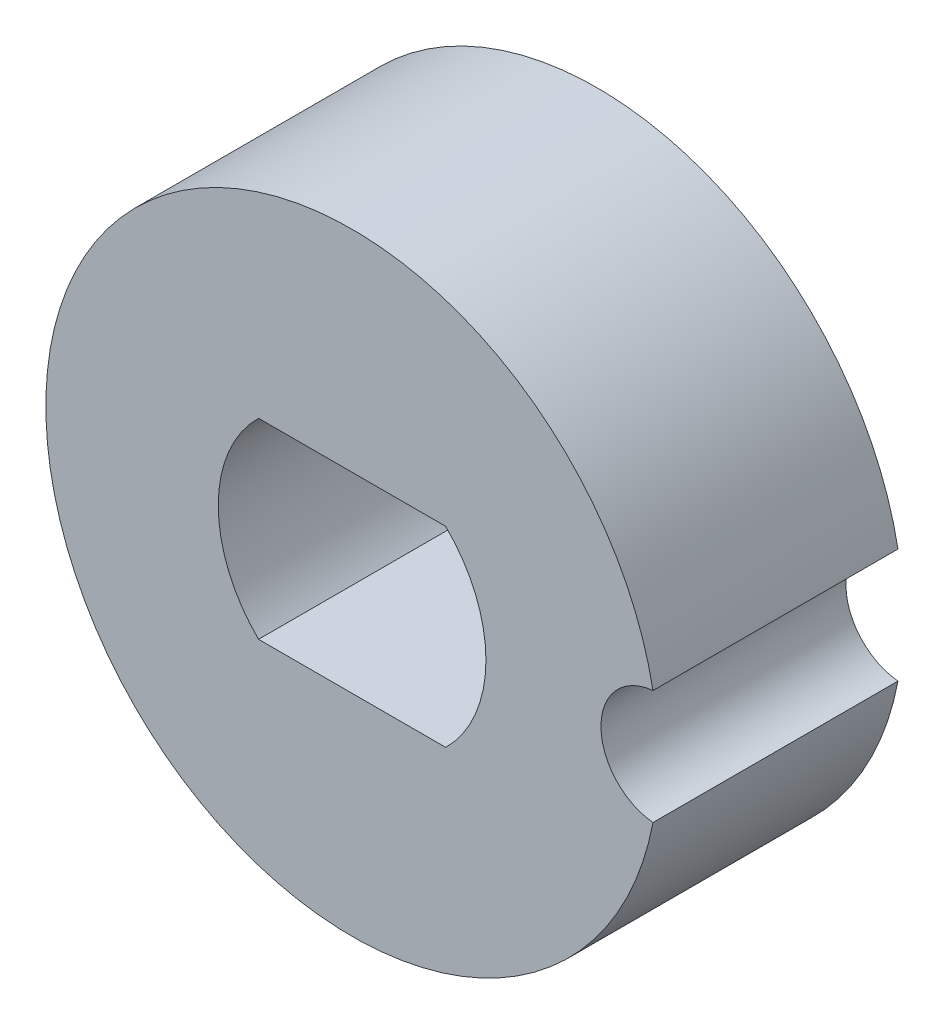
ISO-10303-21;
HEADER;
FILE_DESCRIPTION(('STEP AP214'),'2;1');
FILE_NAME('part.step','',(''),(''),'','','');
FILE_SCHEMA(('AUTOMOTIVE_DESIGN { 1 0 10303 214 1 1 1 1 }'));
ENDSEC;
DATA;
#1=APPLICATION_CONTEXT('core data for automotive mechanical design processes');
#2=APPLICATION_PROTOCOL_DEFINITION('international standard','automotive_design',2000,#1);
#3=PRODUCT_CONTEXT('',#1,'mechanical');
#4=PRODUCT('Part','Part','',(#3));
#5=PRODUCT_RELATED_PRODUCT_CATEGORY('part','',(#4));
#6=PRODUCT_DEFINITION_FORMATION('','',#4);
#7=PRODUCT_DEFINITION_CONTEXT('part definition',#1,'design');
#8=PRODUCT_DEFINITION('design','',#6,#7);
#9=PRODUCT_DEFINITION_SHAPE('','',#8);
#10=(LENGTH_UNIT() NAMED_UNIT(*) SI_UNIT(.MILLI.,.METRE.));
#11=(NAMED_UNIT(*) PLANE_ANGLE_UNIT() SI_UNIT($,.RADIAN.));
#12=(NAMED_UNIT(*) SI_UNIT($,.STERADIAN.) SOLID_ANGLE_UNIT());
#13=UNCERTAINTY_MEASURE_WITH_UNIT(LENGTH_MEASURE(1.E-05),#10,'distance_accuracy_value','');
#14=(GEOMETRIC_REPRESENTATION_CONTEXT(3) GLOBAL_UNCERTAINTY_ASSIGNED_CONTEXT((#13)) GLOBAL_UNIT_ASSIGNED_CONTEXT((#10,
#11,#12)) REPRESENTATION_CONTEXT('',''));
#15=CARTESIAN_POINT('',(0.,0.,0.));
#16=DIRECTION('',(0.,0.,1.));
#17=DIRECTION('',(1.,0.,0.));
#18=AXIS2_PLACEMENT_3D('',#15,#16,#17);
#19=CARTESIAN_POINT('',(6.35,0.,10.16));
#20=DIRECTION('',(0.,0.,1.));
#21=DIRECTION('',(1.,0.,0.));
#22=AXIS2_PLACEMENT_3D('',#19,#20,#21);
#23=PLANE('',#22);
#24=CARTESIAN_POINT('',(0.,0.,10.16));
#25=DIRECTION('',(0.,0.,1.));
#26=DIRECTION('',(1.,0.,0.));
#27=AXIS2_PLACEMENT_3D('',#24,#25,#26);
#28=CIRCLE('',#27,12.7);
#29=CARTESIAN_POINT('',(12.4767578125,2.37076242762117,10.16));
#30=VERTEX_POINT('',#29);
#31=CARTESIAN_POINT('',(12.4767578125,-2.37076242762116,10.16));
#32=VERTEX_POINT('',#31);
#33=EDGE_CURVE('E108',#30,#32,#28,.T.);
#34=ORIENTED_EDGE('',*,*,#33,.T.);
#35=CARTESIAN_POINT('',(12.7,0.,10.16));
#36=DIRECTION('',(0.,0.,1.));
#37=DIRECTION('',(1.,0.,0.));
#38=AXIS2_PLACEMENT_3D('',#35,#36,#37);
#39=CIRCLE('',#38,2.38125);
#40=EDGE_CURVE('E111',#30,#32,#39,.T.);
#41=ORIENTED_EDGE('',*,*,#40,.F.);
#42=EDGE_LOOP('',(#34,#41));
#43=FACE_BOUND('',#42,.T.);
#44=DIRECTION('',(-1.,0.,0.));
#45=VECTOR('',#44,1.);
#46=CARTESIAN_POINT('',(3.87948623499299,-3.96875,10.16));
#47=LINE('',#46,#45);
#48=CARTESIAN_POINT('',(3.87948623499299,-3.96875,10.16));
#49=VERTEX_POINT('',#48);
#50=CARTESIAN_POINT('',(-3.87948623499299,-3.96875,10.16));
#51=VERTEX_POINT('',#50);
#52=EDGE_CURVE('E92',#49,#51,#47,.T.);
#53=ORIENTED_EDGE('',*,*,#52,.T.);
#54=CARTESIAN_POINT('',(0.,0.,10.16));
#55=DIRECTION('',(0.,0.,1.));
#56=DIRECTION('',(1.,0.,0.));
#57=AXIS2_PLACEMENT_3D('',#54,#55,#56);
#58=CIRCLE('',#57,5.5499);
#59=CARTESIAN_POINT('',(-3.87948623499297,3.96875,10.16));
#60=VERTEX_POINT('',#59);
#61=EDGE_CURVE('E68',#60,#51,#58,.T.);
#62=ORIENTED_EDGE('',*,*,#61,.F.);
#63=DIRECTION('',(-1.,0.,0.));
#64=VECTOR('',#63,1.);
#65=CARTESIAN_POINT('',(3.87948623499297,3.96875,10.16));
#66=LINE('',#65,#64);
#67=CARTESIAN_POINT('',(3.87948623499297,3.96875,10.16));
#68=VERTEX_POINT('',#67);
#69=EDGE_CURVE('E95',#68,#60,#66,.T.);
#70=ORIENTED_EDGE('',*,*,#69,.F.);
#71=CARTESIAN_POINT('',(0.,0.,10.16));
#72=DIRECTION('',(0.,0.,1.));
#73=DIRECTION('',(1.,0.,0.));
#74=AXIS2_PLACEMENT_3D('',#71,#72,#73);
#75=CIRCLE('',#74,5.5499);
#76=EDGE_CURVE('E29',#49,#68,#75,.T.);
#77=ORIENTED_EDGE('',*,*,#76,.F.);
#78=EDGE_LOOP('',(#53,#62,#70,#77));
#79=FACE_BOUND('',#78,.T.);
#80=ADVANCED_FACE('F14',(#43,#79),#23,.T.);
#81=CARTESIAN_POINT('',(6.35,0.,0.));
#82=DIRECTION('',(0.,0.,1.));
#83=DIRECTION('',(1.,0.,0.));
#84=AXIS2_PLACEMENT_3D('',#81,#82,#83);
#85=PLANE('',#84);
#86=CARTESIAN_POINT('',(0.,0.,0.));
#87=DIRECTION('',(0.,0.,1.));
#88=DIRECTION('',(1.,0.,0.));
#89=AXIS2_PLACEMENT_3D('',#86,#87,#88);
#90=CIRCLE('',#89,12.7);
#91=CARTESIAN_POINT('',(12.4767578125,2.37076242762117,0.));
#92=VERTEX_POINT('',#91);
#93=CARTESIAN_POINT('',(12.4767578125,-2.37076242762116,0.));
#94=VERTEX_POINT('',#93);
#95=EDGE_CURVE('E72',#92,#94,#90,.T.);
#96=ORIENTED_EDGE('',*,*,#95,.F.);
#97=CARTESIAN_POINT('',(12.7,0.,0.));
#98=DIRECTION('',(0.,0.,1.));
#99=DIRECTION('',(1.,0.,0.));
#100=AXIS2_PLACEMENT_3D('',#97,#98,#99);
#101=CIRCLE('',#100,2.38125);
#102=EDGE_CURVE('E105',#92,#94,#101,.T.);
#103=ORIENTED_EDGE('',*,*,#102,.T.);
#104=EDGE_LOOP('',(#96,#103));
#105=FACE_BOUND('',#104,.T.);
#106=CARTESIAN_POINT('',(0.,0.,0.));
#107=DIRECTION('',(0.,0.,1.));
#108=DIRECTION('',(1.,0.,0.));
#109=AXIS2_PLACEMENT_3D('',#106,#107,#108);
#110=CIRCLE('',#109,5.5499);
#111=CARTESIAN_POINT('',(-3.87948623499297,3.96875,0.));
#112=VERTEX_POINT('',#111);
#113=CARTESIAN_POINT('',(-3.87948623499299,-3.96875,0.));
#114=VERTEX_POINT('',#113);
#115=EDGE_CURVE('E37',#112,#114,#110,.T.);
#116=ORIENTED_EDGE('',*,*,#115,.T.);
#117=DIRECTION('',(-1.,0.,0.));
#118=VECTOR('',#117,1.);
#119=CARTESIAN_POINT('',(3.87948623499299,-3.96875,0.));
#120=LINE('',#119,#118);
#121=CARTESIAN_POINT('',(3.87948623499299,-3.96875,0.));
#122=VERTEX_POINT('',#121);
#123=EDGE_CURVE('E76',#122,#114,#120,.T.);
#124=ORIENTED_EDGE('',*,*,#123,.F.);
#125=CARTESIAN_POINT('',(0.,0.,0.));
#126=DIRECTION('',(0.,0.,1.));
#127=DIRECTION('',(1.,0.,0.));
#128=AXIS2_PLACEMENT_3D('',#125,#126,#127);
#129=CIRCLE('',#128,5.5499);
#130=CARTESIAN_POINT('',(3.87948623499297,3.96875,0.));
#131=VERTEX_POINT('',#130);
#132=EDGE_CURVE('E81',#122,#131,#129,.T.);
#133=ORIENTED_EDGE('',*,*,#132,.T.);
#134=DIRECTION('',(-1.,0.,0.));
#135=VECTOR('',#134,1.);
#136=CARTESIAN_POINT('',(3.87948623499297,3.96875,0.));
#137=LINE('',#136,#135);
#138=EDGE_CURVE('E86',#131,#112,#137,.T.);
#139=ORIENTED_EDGE('',*,*,#138,.T.);
#140=EDGE_LOOP('',(#116,#124,#133,#139));
#141=FACE_BOUND('',#140,.T.);
#142=ADVANCED_FACE('F84',(#105,#141),#85,.F.);
#143=CARTESIAN_POINT('',(0.,0.,10.16));
#144=DIRECTION('',(0.,0.,-1.));
#145=DIRECTION('',(-1.,0.,0.));
#146=AXIS2_PLACEMENT_3D('',#143,#144,#145);
#147=CYLINDRICAL_SURFACE('',#146,12.7);
#148=DIRECTION('',(0.,0.,-1.));
#149=VECTOR('',#148,1.);
#150=CARTESIAN_POINT('',(12.4767578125,-2.37076242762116,10.16));
#151=LINE('',#150,#149);
#152=EDGE_CURVE('E9',#32,#94,#151,.T.);
#153=ORIENTED_EDGE('',*,*,#152,.F.);
#154=ORIENTED_EDGE('',*,*,#33,.F.);
#155=DIRECTION('',(0.,0.,-1.));
#156=VECTOR('',#155,1.);
#157=CARTESIAN_POINT('',(12.4767578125,2.37076242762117,10.16));
#158=LINE('',#157,#156);
#159=EDGE_CURVE('E22',#30,#92,#158,.T.);
#160=ORIENTED_EDGE('',*,*,#159,.T.);
#161=ORIENTED_EDGE('',*,*,#95,.T.);
#162=EDGE_LOOP('',(#153,#154,#160,#161));
#163=FACE_BOUND('',#162,.T.);
#164=ADVANCED_FACE('F116',(#163),#147,.T.);
#165=CARTESIAN_POINT('',(12.7,0.,10.16));
#166=DIRECTION('',(0.,0.,-1.));
#167=DIRECTION('',(-1.,0.,0.));
#168=AXIS2_PLACEMENT_3D('',#165,#166,#167);
#169=CYLINDRICAL_SURFACE('',#168,2.38125);
#170=ORIENTED_EDGE('',*,*,#40,.T.);
#171=ORIENTED_EDGE('',*,*,#152,.T.);
#172=ORIENTED_EDGE('',*,*,#102,.F.);
#173=ORIENTED_EDGE('',*,*,#159,.F.);
#174=EDGE_LOOP('',(#170,#171,#172,#173));
#175=FACE_BOUND('',#174,.T.);
#176=ADVANCED_FACE('F16',(#175),#169,.F.);
#177=CARTESIAN_POINT('',(0.,0.,10.16));
#178=DIRECTION('',(0.,0.,-1.));
#179=DIRECTION('',(-1.,0.,0.));
#180=AXIS2_PLACEMENT_3D('',#177,#178,#179);
#181=CYLINDRICAL_SURFACE('',#180,5.5499);
#182=DIRECTION('',(0.,0.,-1.));
#183=VECTOR('',#182,1.);
#184=CARTESIAN_POINT('',(-3.87948623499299,-3.96875,10.16));
#185=LINE('',#184,#183);
#186=EDGE_CURVE('E64',#51,#114,#185,.T.);
#187=ORIENTED_EDGE('',*,*,#186,.T.);
#188=ORIENTED_EDGE('',*,*,#115,.F.);
#189=DIRECTION('',(0.,0.,-1.));
#190=VECTOR('',#189,1.);
#191=CARTESIAN_POINT('',(-3.87948623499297,3.96875,10.16));
#192=LINE('',#191,#190);
#193=EDGE_CURVE('E98',#60,#112,#192,.T.);
#194=ORIENTED_EDGE('',*,*,#193,.F.);
#195=ORIENTED_EDGE('',*,*,#61,.T.);
#196=EDGE_LOOP('',(#187,#188,#194,#195));
#197=FACE_BOUND('',#196,.T.);
#198=ADVANCED_FACE('F66',(#197),#181,.F.);
#199=CARTESIAN_POINT('',(3.87948623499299,-3.96875,10.16));
#200=DIRECTION('',(0.,-1.,0.));
#201=DIRECTION('',(1.,0.,0.));
#202=AXIS2_PLACEMENT_3D('',#199,#200,#201);
#203=PLANE('',#202);
#204=DIRECTION('',(0.,0.,-1.));
#205=VECTOR('',#204,1.);
#206=CARTESIAN_POINT('',(3.87948623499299,-3.96875,10.16));
#207=LINE('',#206,#205);
#208=EDGE_CURVE('E73',#49,#122,#207,.T.);
#209=ORIENTED_EDGE('',*,*,#208,.T.);
#210=ORIENTED_EDGE('',*,*,#123,.T.);
#211=ORIENTED_EDGE('',*,*,#186,.F.);
#212=ORIENTED_EDGE('',*,*,#52,.F.);
#213=EDGE_LOOP('',(#209,#210,#211,#212));
#214=FACE_BOUND('',#213,.T.);
#215=ADVANCED_FACE('F77',(#214),#203,.F.);
#216=CARTESIAN_POINT('',(0.,0.,10.16));
#217=DIRECTION('',(0.,0.,-1.));
#218=DIRECTION('',(-1.,0.,0.));
#219=AXIS2_PLACEMENT_3D('',#216,#217,#218);
#220=CYLINDRICAL_SURFACE('',#219,5.5499);
#221=DIRECTION('',(0.,0.,-1.));
#222=VECTOR('',#221,1.);
#223=CARTESIAN_POINT('',(3.87948623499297,3.96875,10.16));
#224=LINE('',#223,#222);
#225=EDGE_CURVE('E100',#68,#131,#224,.T.);
#226=ORIENTED_EDGE('',*,*,#225,.T.);
#227=ORIENTED_EDGE('',*,*,#132,.F.);
#228=ORIENTED_EDGE('',*,*,#208,.F.);
#229=ORIENTED_EDGE('',*,*,#76,.T.);
#230=EDGE_LOOP('',(#226,#227,#228,#229));
#231=FACE_BOUND('',#230,.T.);
#232=ADVANCED_FACE('F128',(#231),#220,.F.);
#233=CARTESIAN_POINT('',(3.87948623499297,3.96875,10.16));
#234=DIRECTION('',(0.,-1.,0.));
#235=DIRECTION('',(1.,0.,0.));
#236=AXIS2_PLACEMENT_3D('',#233,#234,#235);
#237=PLANE('',#236);
#238=ORIENTED_EDGE('',*,*,#69,.T.);
#239=ORIENTED_EDGE('',*,*,#193,.T.);
#240=ORIENTED_EDGE('',*,*,#138,.F.);
#241=ORIENTED_EDGE('',*,*,#225,.F.);
#242=EDGE_LOOP('',(#238,#239,#240,#241));
#243=FACE_BOUND('',#242,.T.);
#244=ADVANCED_FACE('F127',(#243),#237,.T.);
#245=CLOSED_SHELL('',(#80,#142,#164,#176,#198,#215,#232,#244));
#246=MANIFOLD_SOLID_BREP('B1',#245);
#247=ADVANCED_BREP_SHAPE_REPRESENTATION('',(#18,#246),#14);
#248=SHAPE_DEFINITION_REPRESENTATION(#9,#247);
ENDSEC;
END-ISO-10303-21;
